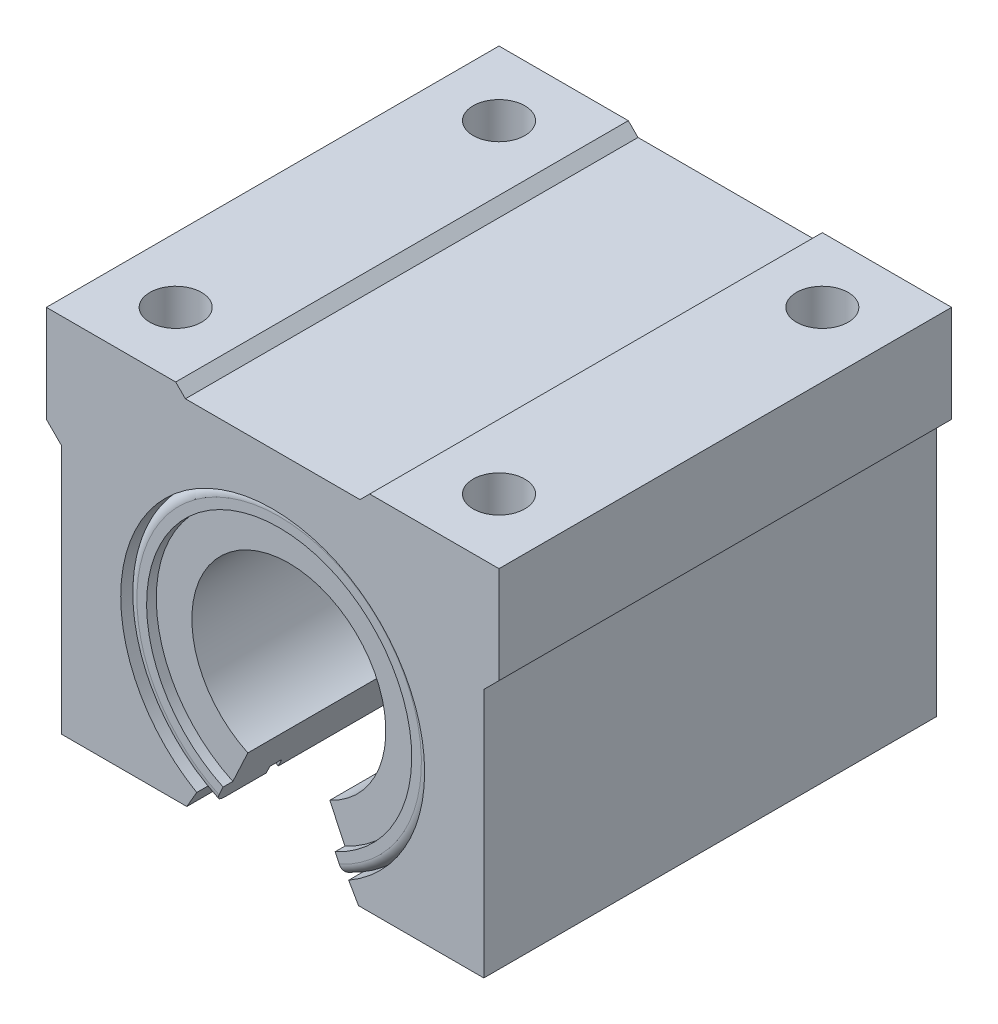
ISO-10303-21;
HEADER;
FILE_DESCRIPTION(('STEP AP214'),'2;1');
FILE_NAME('part.step','',(''),(''),'','','');
FILE_SCHEMA(('AUTOMOTIVE_DESIGN { 1 0 10303 214 1 1 1 1 }'));
ENDSEC;
DATA;
#1=APPLICATION_CONTEXT('core data for automotive mechanical design processes');
#2=APPLICATION_PROTOCOL_DEFINITION('international standard','automotive_design',2000,#1);
#3=PRODUCT_CONTEXT('',#1,'mechanical');
#4=PRODUCT('Part','Part','',(#3));
#5=PRODUCT_RELATED_PRODUCT_CATEGORY('part','',(#4));
#6=PRODUCT_DEFINITION_FORMATION('','',#4);
#7=PRODUCT_DEFINITION_CONTEXT('part definition',#1,'design');
#8=PRODUCT_DEFINITION('design','',#6,#7);
#9=PRODUCT_DEFINITION_SHAPE('','',#8);
#10=(LENGTH_UNIT() NAMED_UNIT(*) SI_UNIT(.MILLI.,.METRE.));
#11=(NAMED_UNIT(*) PLANE_ANGLE_UNIT() SI_UNIT($,.RADIAN.));
#12=(NAMED_UNIT(*) SI_UNIT($,.STERADIAN.) SOLID_ANGLE_UNIT());
#13=UNCERTAINTY_MEASURE_WITH_UNIT(LENGTH_MEASURE(1.E-05),#10,'distance_accuracy_value','');
#14=(GEOMETRIC_REPRESENTATION_CONTEXT(3) GLOBAL_UNCERTAINTY_ASSIGNED_CONTEXT((#13)) GLOBAL_UNIT_ASSIGNED_CONTEXT((#10,
#11,#12)) REPRESENTATION_CONTEXT('',''));
#15=CARTESIAN_POINT('',(0.,0.,0.));
#16=DIRECTION('',(0.,0.,1.));
#17=DIRECTION('',(1.,0.,0.));
#18=AXIS2_PLACEMENT_3D('',#15,#16,#17);
#19=CARTESIAN_POINT('',(0.,0.,34.));
#20=DIRECTION('',(0.,0.,-1.));
#21=DIRECTION('',(-1.,0.,0.));
#22=AXIS2_PLACEMENT_3D('',#19,#20,#21);
#23=CYLINDRICAL_SURFACE('',#22,15.);
#24=DIRECTION('',(0.,0.,-1.));
#25=VECTOR('',#24,1.);
#26=CARTESIAN_POINT('',(6.3392739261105,-13.5946168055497,34.));
#27=LINE('',#26,#25);
#28=CARTESIAN_POINT('',(6.3392739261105,-13.5946168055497,32.5));
#29=VERTEX_POINT('',#28);
#30=CARTESIAN_POINT('',(6.3392739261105,-13.5946168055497,-32.5));
#31=VERTEX_POINT('',#30);
#32=EDGE_CURVE('P0_E38',#29,#31,#27,.T.);
#33=ORIENTED_EDGE('',*,*,#32,.F.);
#34=CARTESIAN_POINT('',(0.,0.,32.5));
#35=DIRECTION('',(0.,0.,1.));
#36=DIRECTION('',(1.,0.,0.));
#37=AXIS2_PLACEMENT_3D('',#34,#35,#36);
#38=CIRCLE('',#37,15.);
#39=CARTESIAN_POINT('',(-6.3392739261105,-13.5946168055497,32.5));
#40=VERTEX_POINT('',#39);
#41=EDGE_CURVE('P0_E168',#29,#40,#38,.T.);
#42=ORIENTED_EDGE('',*,*,#41,.T.);
#43=DIRECTION('',(0.,0.,-1.));
#44=VECTOR('',#43,1.);
#45=CARTESIAN_POINT('',(-6.3392739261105,-13.5946168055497,34.));
#46=LINE('',#45,#44);
#47=CARTESIAN_POINT('',(-6.3392739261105,-13.5946168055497,-32.5));
#48=VERTEX_POINT('',#47);
#49=EDGE_CURVE('P0_E211',#48,#40,#46,.F.);
#50=ORIENTED_EDGE('',*,*,#49,.F.);
#51=CARTESIAN_POINT('',(0.,0.,-32.5));
#52=DIRECTION('',(0.,0.,-1.));
#53=DIRECTION('',(-1.,0.,0.));
#54=AXIS2_PLACEMENT_3D('',#51,#52,#53);
#55=CIRCLE('',#54,15.);
#56=EDGE_CURVE('P0_E166',#48,#31,#55,.T.);
#57=ORIENTED_EDGE('',*,*,#56,.T.);
#58=EDGE_LOOP('',(#33,#42,#50,#57));
#59=FACE_BOUND('',#58,.T.);
#60=ADVANCED_FACE('P0_F16',(#59),#23,.F.);
#61=CARTESIAN_POINT('',(0.,0.,-34.));
#62=DIRECTION('',(0.,0.,1.));
#63=DIRECTION('',(1.,0.,0.));
#64=AXIS2_PLACEMENT_3D('',#61,#62,#63);
#65=PLANE('',#64);
#66=CARTESIAN_POINT('',(0.,0.,-34.));
#67=DIRECTION('',(0.,0.,1.));
#68=DIRECTION('',(1.,0.,0.));
#69=AXIS2_PLACEMENT_3D('',#66,#67,#68);
#70=CIRCLE('',#69,22.);
#71=CARTESIAN_POINT('',(-9.29760175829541,-19.9387713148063,-34.));
#72=VERTEX_POINT('',#71);
#73=CARTESIAN_POINT('',(9.29760175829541,-19.9387713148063,-34.));
#74=VERTEX_POINT('',#73);
#75=EDGE_CURVE('P0_E202',#72,#74,#70,.F.);
#76=ORIENTED_EDGE('',*,*,#75,.T.);
#77=DIRECTION('',(-0.4226182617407,0.90630778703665,0.));
#78=VECTOR('',#77,1.);
#79=CARTESIAN_POINT('',(0.,0.,-34.));
#80=LINE('',#79,#78);
#81=CARTESIAN_POINT('',(8.66367436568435,-18.5793096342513,-34.));
#82=VERTEX_POINT('',#81);
#83=EDGE_CURVE('P0_E159',#74,#82,#80,.T.);
#84=ORIENTED_EDGE('',*,*,#83,.T.);
#85=CARTESIAN_POINT('',(0.,0.,-34.));
#86=DIRECTION('',(0.,0.,1.));
#87=DIRECTION('',(1.,0.,0.));
#88=AXIS2_PLACEMENT_3D('',#85,#86,#87);
#89=CIRCLE('',#88,20.5);
#90=CARTESIAN_POINT('',(-8.66367436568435,-18.5793096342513,-34.));
#91=VERTEX_POINT('',#90);
#92=EDGE_CURVE('P0_E228',#82,#91,#89,.T.);
#93=ORIENTED_EDGE('',*,*,#92,.T.);
#94=DIRECTION('',(-0.4226182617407,-0.90630778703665,0.));
#95=VECTOR('',#94,1.);
#96=CARTESIAN_POINT('',(0.,0.,-34.));
#97=LINE('',#96,#95);
#98=EDGE_CURVE('P0_E258',#91,#72,#97,.T.);
#99=ORIENTED_EDGE('',*,*,#98,.T.);
#100=EDGE_LOOP('',(#76,#84,#93,#99));
#101=FACE_BOUND('',#100,.T.);
#102=ADVANCED_FACE('P0_F257',(#101),#65,.F.);
#103=CARTESIAN_POINT('',(0.,0.,34.));
#104=DIRECTION('',(0.,0.,-1.));
#105=DIRECTION('',(-1.,0.,0.));
#106=AXIS2_PLACEMENT_3D('',#103,#104,#105);
#107=CYLINDRICAL_SURFACE('',#106,23.5);
#108=CARTESIAN_POINT('',(0.,0.,24.2));
#109=DIRECTION('',(0.,0.,1.));
#110=DIRECTION('',(1.,0.,0.));
#111=AXIS2_PLACEMENT_3D('',#108,#109,#110);
#112=CIRCLE('',#111,23.5);
#113=CARTESIAN_POINT('',(9.93152915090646,-21.2982329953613,24.2));
#114=VERTEX_POINT('',#113);
#115=CARTESIAN_POINT('',(-9.93152915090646,-21.2982329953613,24.2));
#116=VERTEX_POINT('',#115);
#117=EDGE_CURVE('P0_E187',#114,#116,#112,.T.);
#118=ORIENTED_EDGE('',*,*,#117,.F.);
#119=DIRECTION('',(0.,0.,1.));
#120=VECTOR('',#119,1.);
#121=CARTESIAN_POINT('',(9.93152915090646,-21.2982329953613,-34.));
#122=LINE('',#121,#120);
#123=CARTESIAN_POINT('',(9.93152915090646,-21.2982329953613,-24.2));
#124=VERTEX_POINT('',#123);
#125=EDGE_CURVE('P0_E268',#124,#114,#122,.T.);
#126=ORIENTED_EDGE('',*,*,#125,.F.);
#127=CARTESIAN_POINT('',(0.,0.,-24.2));
#128=DIRECTION('',(0.,0.,1.));
#129=DIRECTION('',(1.,0.,0.));
#130=AXIS2_PLACEMENT_3D('',#127,#128,#129);
#131=CIRCLE('',#130,23.5);
#132=CARTESIAN_POINT('',(-9.93152915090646,-21.2982329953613,-24.2));
#133=VERTEX_POINT('',#132);
#134=EDGE_CURVE('P0_E184',#124,#133,#131,.T.);
#135=ORIENTED_EDGE('',*,*,#134,.T.);
#136=DIRECTION('',(0.,0.,1.));
#137=VECTOR('',#136,1.);
#138=CARTESIAN_POINT('',(-9.93152915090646,-21.2982329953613,-34.));
#139=LINE('',#138,#137);
#140=EDGE_CURVE('P0_E273',#133,#116,#139,.T.);
#141=ORIENTED_EDGE('',*,*,#140,.T.);
#142=EDGE_LOOP('',(#118,#126,#135,#141));
#143=FACE_BOUND('',#142,.T.);
#144=ADVANCED_FACE('P0_F325',(#143),#107,.T.);
#145=CARTESIAN_POINT('',(0.,0.,-26.05));
#146=DIRECTION('',(0.,0.,1.));
#147=DIRECTION('',(1.,0.,0.));
#148=AXIS2_PLACEMENT_3D('',#145,#146,#147);
#149=CIRCLE('',#148,23.5);
#150=CARTESIAN_POINT('',(9.93152915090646,-21.2982329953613,-26.05));
#151=VERTEX_POINT('',#150);
#152=CARTESIAN_POINT('',(-9.93152915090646,-21.2982329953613,-26.05));
#153=VERTEX_POINT('',#152);
#154=EDGE_CURVE('P0_E181',#151,#153,#149,.T.);
#155=ORIENTED_EDGE('',*,*,#154,.F.);
#156=CARTESIAN_POINT('',(9.93152915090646,-21.2982329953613,-32.5));
#157=VERTEX_POINT('',#156);
#158=EDGE_CURVE('P0_E270',#157,#151,#122,.T.);
#159=ORIENTED_EDGE('',*,*,#158,.F.);
#160=CARTESIAN_POINT('',(0.,0.,-32.5));
#161=DIRECTION('',(0.,0.,1.));
#162=DIRECTION('',(1.,0.,0.));
#163=AXIS2_PLACEMENT_3D('',#160,#161,#162);
#164=CIRCLE('',#163,23.5);
#165=CARTESIAN_POINT('',(-9.93152915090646,-21.2982329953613,-32.5));
#166=VERTEX_POINT('',#165);
#167=EDGE_CURVE('P0_E199',#157,#166,#164,.T.);
#168=ORIENTED_EDGE('',*,*,#167,.T.);
#169=EDGE_CURVE('P0_E269',#166,#153,#139,.T.);
#170=ORIENTED_EDGE('',*,*,#169,.T.);
#171=EDGE_LOOP('',(#155,#159,#168,#170));
#172=FACE_BOUND('',#171,.T.);
#173=ADVANCED_FACE('P0_F333',(#172),#107,.T.);
#174=CARTESIAN_POINT('',(0.,0.,32.5));
#175=DIRECTION('',(0.,0.,1.));
#176=DIRECTION('',(1.,0.,0.));
#177=AXIS2_PLACEMENT_3D('',#174,#175,#176);
#178=CIRCLE('',#177,23.5);
#179=CARTESIAN_POINT('',(-9.93152915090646,-21.2982329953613,32.5));
#180=VERTEX_POINT('',#179);
#181=CARTESIAN_POINT('',(9.93152915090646,-21.2982329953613,32.5));
#182=VERTEX_POINT('',#181);
#183=EDGE_CURVE('P0_E206',#180,#182,#178,.F.);
#184=ORIENTED_EDGE('',*,*,#183,.T.);
#185=CARTESIAN_POINT('',(9.93152915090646,-21.2982329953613,26.05));
#186=VERTEX_POINT('',#185);
#187=EDGE_CURVE('P0_E266',#186,#182,#122,.T.);
#188=ORIENTED_EDGE('',*,*,#187,.F.);
#189=CARTESIAN_POINT('',(0.,0.,26.05));
#190=DIRECTION('',(0.,0.,1.));
#191=DIRECTION('',(1.,0.,0.));
#192=AXIS2_PLACEMENT_3D('',#189,#190,#191);
#193=CIRCLE('',#192,23.5);
#194=CARTESIAN_POINT('',(-9.93152915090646,-21.2982329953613,26.05));
#195=VERTEX_POINT('',#194);
#196=EDGE_CURVE('P0_E196',#186,#195,#193,.T.);
#197=ORIENTED_EDGE('',*,*,#196,.T.);
#198=EDGE_CURVE('P0_E262',#195,#180,#139,.T.);
#199=ORIENTED_EDGE('',*,*,#198,.T.);
#200=EDGE_LOOP('',(#184,#188,#197,#199));
#201=FACE_BOUND('',#200,.T.);
#202=ADVANCED_FACE('P0_F305',(#201),#107,.T.);
#203=CARTESIAN_POINT('',(0.,0.,34.));
#204=DIRECTION('',(0.,0.,1.));
#205=DIRECTION('',(1.,0.,0.));
#206=AXIS2_PLACEMENT_3D('',#203,#204,#205);
#207=PLANE('',#206);
#208=DIRECTION('',(-0.4226182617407,0.90630778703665,0.));
#209=VECTOR('',#208,1.);
#210=CARTESIAN_POINT('',(0.,0.,34.));
#211=LINE('',#210,#209);
#212=CARTESIAN_POINT('',(9.29760175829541,-19.9387713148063,34.));
#213=VERTEX_POINT('',#212);
#214=CARTESIAN_POINT('',(8.66367436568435,-18.5793096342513,34.));
#215=VERTEX_POINT('',#214);
#216=EDGE_CURVE('P0_E160',#213,#215,#211,.T.);
#217=ORIENTED_EDGE('',*,*,#216,.F.);
#218=CARTESIAN_POINT('',(0.,0.,34.));
#219=DIRECTION('',(0.,0.,1.));
#220=DIRECTION('',(1.,0.,0.));
#221=AXIS2_PLACEMENT_3D('',#218,#219,#220);
#222=CIRCLE('',#221,22.);
#223=CARTESIAN_POINT('',(-9.29760175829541,-19.9387713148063,34.));
#224=VERTEX_POINT('',#223);
#225=EDGE_CURVE('P0_E158',#213,#224,#222,.T.);
#226=ORIENTED_EDGE('',*,*,#225,.T.);
#227=DIRECTION('',(-0.4226182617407,-0.90630778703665,0.));
#228=VECTOR('',#227,1.);
#229=CARTESIAN_POINT('',(0.,0.,34.));
#230=LINE('',#229,#228);
#231=CARTESIAN_POINT('',(-8.66367436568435,-18.5793096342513,34.));
#232=VERTEX_POINT('',#231);
#233=EDGE_CURVE('P0_E141',#232,#224,#230,.T.);
#234=ORIENTED_EDGE('',*,*,#233,.F.);
#235=CARTESIAN_POINT('',(0.,0.,34.));
#236=DIRECTION('',(0.,0.,1.));
#237=DIRECTION('',(1.,0.,0.));
#238=AXIS2_PLACEMENT_3D('',#235,#236,#237);
#239=CIRCLE('',#238,20.5);
#240=EDGE_CURVE('P0_E156',#215,#232,#239,.T.);
#241=ORIENTED_EDGE('',*,*,#240,.F.);
#242=EDGE_LOOP('',(#217,#226,#234,#241));
#243=FACE_BOUND('',#242,.T.);
#244=ADVANCED_FACE('P0_F155',(#243),#207,.T.);
#245=CARTESIAN_POINT('',(-1.64099622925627E-13,-23.5,26.05));
#246=DIRECTION('',(0.,0.,-1.));
#247=DIRECTION('',(-1.,0.,0.));
#248=AXIS2_PLACEMENT_3D('',#245,#246,#247);
#249=PLANE('',#248);
#250=DIRECTION('',(0.4226182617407,-0.90630778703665,0.));
#251=VECTOR('',#250,1.);
#252=CARTESIAN_POINT('',(9.00102220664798,-19.3027544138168,26.05));
#253=LINE('',#252,#251);
#254=CARTESIAN_POINT('',(9.40325632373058,-20.1653482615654,26.05));
#255=VERTEX_POINT('',#254);
#256=EDGE_CURVE('P0_E253',#255,#186,#253,.T.);
#257=ORIENTED_EDGE('',*,*,#256,.F.);
#258=CARTESIAN_POINT('',(0.,0.,26.05));
#259=DIRECTION('',(0.,0.,1.));
#260=DIRECTION('',(1.,0.,0.));
#261=AXIS2_PLACEMENT_3D('',#258,#259,#260);
#262=CIRCLE('',#261,22.25);
#263=CARTESIAN_POINT('',(-9.40325632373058,-20.1653482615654,26.05));
#264=VERTEX_POINT('',#263);
#265=EDGE_CURVE('P0_E193',#255,#264,#262,.T.);
#266=ORIENTED_EDGE('',*,*,#265,.T.);
#267=DIRECTION('',(0.4226182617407,0.90630778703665,0.));
#268=VECTOR('',#267,1.);
#269=CARTESIAN_POINT('',(-9.00102220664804,-19.3027544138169,26.05));
#270=LINE('',#269,#268);
#271=EDGE_CURVE('P0_E229',#195,#264,#270,.T.);
#272=ORIENTED_EDGE('',*,*,#271,.F.);
#273=ORIENTED_EDGE('',*,*,#196,.F.);
#274=EDGE_LOOP('',(#257,#266,#272,#273));
#275=FACE_BOUND('',#274,.T.);
#276=ADVANCED_FACE('P0_F303',(#275),#249,.T.);
#277=CARTESIAN_POINT('',(0.,0.,0.));
#278=DIRECTION('',(0.,0.,1.));
#279=DIRECTION('',(1.,0.,0.));
#280=AXIS2_PLACEMENT_3D('',#277,#278,#279);
#281=CYLINDRICAL_SURFACE('',#280,22.25);
#282=DIRECTION('',(0.,0.,1.));
#283=VECTOR('',#282,1.);
#284=CARTESIAN_POINT('',(9.40325632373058,-20.1653482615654,0.));
#285=LINE('',#284,#283);
#286=CARTESIAN_POINT('',(9.40325632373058,-20.1653482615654,24.2));
#287=VERTEX_POINT('',#286);
#288=EDGE_CURVE('P0_E251',#287,#255,#285,.T.);
#289=ORIENTED_EDGE('',*,*,#288,.F.);
#290=CARTESIAN_POINT('',(0.,0.,24.2));
#291=DIRECTION('',(0.,0.,1.));
#292=DIRECTION('',(1.,0.,0.));
#293=AXIS2_PLACEMENT_3D('',#290,#291,#292);
#294=CIRCLE('',#293,22.25);
#295=CARTESIAN_POINT('',(-9.40325632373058,-20.1653482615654,24.2));
#296=VERTEX_POINT('',#295);
#297=EDGE_CURVE('P0_E190',#287,#296,#294,.T.);
#298=ORIENTED_EDGE('',*,*,#297,.T.);
#299=DIRECTION('',(0.,0.,1.));
#300=VECTOR('',#299,1.);
#301=CARTESIAN_POINT('',(-9.40325632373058,-20.1653482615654,0.));
#302=LINE('',#301,#300);
#303=EDGE_CURVE('P0_E233',#264,#296,#302,.F.);
#304=ORIENTED_EDGE('',*,*,#303,.F.);
#305=ORIENTED_EDGE('',*,*,#265,.F.);
#306=EDGE_LOOP('',(#289,#298,#304,#305));
#307=FACE_BOUND('',#306,.T.);
#308=ADVANCED_FACE('P0_F298',(#307),#281,.T.);
#309=CARTESIAN_POINT('',(-1.55370919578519E-13,-22.25,24.2));
#310=DIRECTION('',(0.,0.,1.));
#311=DIRECTION('',(1.,0.,0.));
#312=AXIS2_PLACEMENT_3D('',#309,#310,#311);
#313=PLANE('',#312);
#314=DIRECTION('',(-0.4226182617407,0.90630778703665,0.));
#315=VECTOR('',#314,1.);
#316=CARTESIAN_POINT('',(8.52224442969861,-18.2760121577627,24.2));
#317=LINE('',#316,#315);
#318=EDGE_CURVE('P0_E249',#114,#287,#317,.T.);
#319=ORIENTED_EDGE('',*,*,#318,.F.);
#320=ORIENTED_EDGE('',*,*,#117,.T.);
#321=DIRECTION('',(-0.4226182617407,-0.90630778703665,0.));
#322=VECTOR('',#321,1.);
#323=CARTESIAN_POINT('',(-8.52224442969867,-18.2760121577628,24.2));
#324=LINE('',#323,#322);
#325=EDGE_CURVE('P0_E285',#296,#116,#324,.T.);
#326=ORIENTED_EDGE('',*,*,#325,.F.);
#327=ORIENTED_EDGE('',*,*,#297,.F.);
#328=EDGE_LOOP('',(#319,#320,#326,#327));
#329=FACE_BOUND('',#328,.T.);
#330=ADVANCED_FACE('P0_F295',(#329),#313,.T.);
#331=CARTESIAN_POINT('',(-1.55370919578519E-13,-22.25,-24.2));
#332=DIRECTION('',(0.,0.,-1.));
#333=DIRECTION('',(-1.,0.,0.));
#334=AXIS2_PLACEMENT_3D('',#331,#332,#333);
#335=PLANE('',#334);
#336=DIRECTION('',(0.4226182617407,-0.90630778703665,0.));
#337=VECTOR('',#336,1.);
#338=CARTESIAN_POINT('',(8.52224442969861,-18.2760121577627,-24.2));
#339=LINE('',#338,#337);
#340=CARTESIAN_POINT('',(9.40325632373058,-20.1653482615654,-24.2));
#341=VERTEX_POINT('',#340);
#342=EDGE_CURVE('P0_E247',#341,#124,#339,.T.);
#343=ORIENTED_EDGE('',*,*,#342,.F.);
#344=CARTESIAN_POINT('',(0.,0.,-24.2));
#345=DIRECTION('',(0.,0.,1.));
#346=DIRECTION('',(1.,0.,0.));
#347=AXIS2_PLACEMENT_3D('',#344,#345,#346);
#348=CIRCLE('',#347,22.25);
#349=CARTESIAN_POINT('',(-9.40325632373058,-20.1653482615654,-24.2));
#350=VERTEX_POINT('',#349);
#351=EDGE_CURVE('P0_E175',#341,#350,#348,.T.);
#352=ORIENTED_EDGE('',*,*,#351,.T.);
#353=DIRECTION('',(0.4226182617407,0.90630778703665,0.));
#354=VECTOR('',#353,1.);
#355=CARTESIAN_POINT('',(-8.52224442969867,-18.2760121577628,-24.2));
#356=LINE('',#355,#354);
#357=EDGE_CURVE('P0_E283',#133,#350,#356,.T.);
#358=ORIENTED_EDGE('',*,*,#357,.F.);
#359=ORIENTED_EDGE('',*,*,#134,.F.);
#360=EDGE_LOOP('',(#343,#352,#358,#359));
#361=FACE_BOUND('',#360,.T.);
#362=ADVANCED_FACE('P0_F361',(#361),#335,.T.);
#363=CARTESIAN_POINT('',(-1.64099622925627E-13,-23.5,-26.05));
#364=DIRECTION('',(0.,0.,1.));
#365=DIRECTION('',(1.,0.,0.));
#366=AXIS2_PLACEMENT_3D('',#363,#364,#365);
#367=PLANE('',#366);
#368=DIRECTION('',(-0.4226182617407,0.90630778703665,0.));
#369=VECTOR('',#368,1.);
#370=CARTESIAN_POINT('',(9.00102220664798,-19.3027544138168,-26.05));
#371=LINE('',#370,#369);
#372=CARTESIAN_POINT('',(9.40325632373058,-20.1653482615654,-26.05));
#373=VERTEX_POINT('',#372);
#374=EDGE_CURVE('P0_E245',#151,#373,#371,.T.);
#375=ORIENTED_EDGE('',*,*,#374,.F.);
#376=ORIENTED_EDGE('',*,*,#154,.T.);
#377=DIRECTION('',(-0.4226182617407,-0.90630778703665,0.));
#378=VECTOR('',#377,1.);
#379=CARTESIAN_POINT('',(-9.00102220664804,-19.3027544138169,-26.05));
#380=LINE('',#379,#378);
#381=CARTESIAN_POINT('',(-9.40325632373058,-20.1653482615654,-26.05));
#382=VERTEX_POINT('',#381);
#383=EDGE_CURVE('P0_E281',#382,#153,#380,.T.);
#384=ORIENTED_EDGE('',*,*,#383,.F.);
#385=CARTESIAN_POINT('',(0.,0.,-26.05));
#386=DIRECTION('',(0.,0.,1.));
#387=DIRECTION('',(1.,0.,0.));
#388=AXIS2_PLACEMENT_3D('',#385,#386,#387);
#389=CIRCLE('',#388,22.25);
#390=EDGE_CURVE('P0_E178',#373,#382,#389,.T.);
#391=ORIENTED_EDGE('',*,*,#390,.F.);
#392=EDGE_LOOP('',(#375,#376,#384,#391));
#393=FACE_BOUND('',#392,.T.);
#394=ADVANCED_FACE('P0_F353',(#393),#367,.T.);
#395=CARTESIAN_POINT('',(0.,0.,0.));
#396=DIRECTION('',(0.,0.,1.));
#397=DIRECTION('',(1.,0.,0.));
#398=AXIS2_PLACEMENT_3D('',#395,#396,#397);
#399=CYLINDRICAL_SURFACE('',#398,22.25);
#400=DIRECTION('',(0.,0.,1.));
#401=VECTOR('',#400,1.);
#402=CARTESIAN_POINT('',(9.40325632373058,-20.1653482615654,0.));
#403=LINE('',#402,#401);
#404=EDGE_CURVE('P0_E243',#373,#341,#403,.T.);
#405=ORIENTED_EDGE('',*,*,#404,.F.);
#406=ORIENTED_EDGE('',*,*,#390,.T.);
#407=DIRECTION('',(0.,0.,1.));
#408=VECTOR('',#407,1.);
#409=CARTESIAN_POINT('',(-9.40325632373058,-20.1653482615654,0.));
#410=LINE('',#409,#408);
#411=EDGE_CURVE('P0_E279',#350,#382,#410,.F.);
#412=ORIENTED_EDGE('',*,*,#411,.F.);
#413=ORIENTED_EDGE('',*,*,#351,.F.);
#414=EDGE_LOOP('',(#405,#406,#412,#413));
#415=FACE_BOUND('',#414,.T.);
#416=ADVANCED_FACE('P0_F318',(#415),#399,.T.);
#417=CARTESIAN_POINT('',(0.,0.,-32.5));
#418=DIRECTION('',(0.,0.,1.));
#419=DIRECTION('',(1.,0.,0.));
#420=AXIS2_PLACEMENT_3D('',#417,#418,#419);
#421=TOROIDAL_SURFACE('',#420,22.,1.5);
#422=CARTESIAN_POINT('',(9.29760175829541,-19.9387713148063,-32.5));
#423=DIRECTION('',(0.90630778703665,0.4226182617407,0.));
#424=DIRECTION('',(-0.4226182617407,0.90630778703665,0.));
#425=AXIS2_PLACEMENT_3D('',#422,#423,#424);
#426=CIRCLE('',#425,1.5);
#427=EDGE_CURVE('P0_E241',#74,#157,#426,.F.);
#428=ORIENTED_EDGE('',*,*,#427,.F.);
#429=ORIENTED_EDGE('',*,*,#75,.F.);
#430=CARTESIAN_POINT('',(-9.29760175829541,-19.9387713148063,-32.5));
#431=DIRECTION('',(-0.90630778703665,0.4226182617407,0.));
#432=DIRECTION('',(-0.4226182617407,-0.90630778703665,0.));
#433=AXIS2_PLACEMENT_3D('',#430,#431,#432);
#434=CIRCLE('',#433,1.5);
#435=EDGE_CURVE('P0_E277',#166,#72,#434,.F.);
#436=ORIENTED_EDGE('',*,*,#435,.F.);
#437=ORIENTED_EDGE('',*,*,#167,.F.);
#438=EDGE_LOOP('',(#428,#429,#436,#437));
#439=FACE_BOUND('',#438,.T.);
#440=ADVANCED_FACE('P0_F310',(#439),#421,.T.);
#441=CARTESIAN_POINT('',(0.,0.,32.5));
#442=DIRECTION('',(0.,0.,1.));
#443=DIRECTION('',(1.,0.,0.));
#444=AXIS2_PLACEMENT_3D('',#441,#442,#443);
#445=TOROIDAL_SURFACE('',#444,22.,1.5);
#446=CARTESIAN_POINT('',(9.29760175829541,-19.9387713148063,32.5));
#447=DIRECTION('',(0.90630778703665,0.4226182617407,0.));
#448=DIRECTION('',(-0.4226182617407,0.90630778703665,0.));
#449=AXIS2_PLACEMENT_3D('',#446,#447,#448);
#450=CIRCLE('',#449,1.5);
#451=EDGE_CURVE('P0_E239',#182,#213,#450,.F.);
#452=ORIENTED_EDGE('',*,*,#451,.F.);
#453=ORIENTED_EDGE('',*,*,#183,.F.);
#454=CARTESIAN_POINT('',(-9.29760175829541,-19.9387713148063,32.5));
#455=DIRECTION('',(-0.90630778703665,0.4226182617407,0.));
#456=DIRECTION('',(-0.4226182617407,-0.90630778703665,0.));
#457=AXIS2_PLACEMENT_3D('',#454,#455,#456);
#458=CIRCLE('',#457,1.5);
#459=EDGE_CURVE('P0_E149',#224,#180,#458,.F.);
#460=ORIENTED_EDGE('',*,*,#459,.F.);
#461=ORIENTED_EDGE('',*,*,#225,.F.);
#462=EDGE_LOOP('',(#452,#453,#460,#461));
#463=FACE_BOUND('',#462,.T.);
#464=ADVANCED_FACE('P0_F18',(#463),#445,.T.);
#465=CARTESIAN_POINT('',(0.,0.,32.5));
#466=DIRECTION('',(0.,0.,1.));
#467=DIRECTION('',(1.,0.,0.));
#468=AXIS2_PLACEMENT_3D('',#465,#466,#467);
#469=CYLINDRICAL_SURFACE('',#468,20.5);
#470=CARTESIAN_POINT('',(0.,0.,32.5));
#471=DIRECTION('',(0.,0.,1.));
#472=DIRECTION('',(1.,0.,0.));
#473=AXIS2_PLACEMENT_3D('',#470,#471,#472);
#474=CIRCLE('',#473,20.5);
#475=CARTESIAN_POINT('',(8.66367436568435,-18.5793096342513,32.5));
#476=VERTEX_POINT('',#475);
#477=CARTESIAN_POINT('',(-8.66367436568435,-18.5793096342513,32.5));
#478=VERTEX_POINT('',#477);
#479=EDGE_CURVE('P0_E165',#476,#478,#474,.T.);
#480=ORIENTED_EDGE('',*,*,#479,.F.);
#481=DIRECTION('',(0.,0.,1.));
#482=VECTOR('',#481,1.);
#483=CARTESIAN_POINT('',(8.66367436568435,-18.5793096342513,32.5));
#484=LINE('',#483,#482);
#485=EDGE_CURVE('P0_E164',#476,#215,#484,.T.);
#486=ORIENTED_EDGE('',*,*,#485,.T.);
#487=ORIENTED_EDGE('',*,*,#240,.T.);
#488=DIRECTION('',(0.,0.,1.));
#489=VECTOR('',#488,1.);
#490=CARTESIAN_POINT('',(-8.66367436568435,-18.5793096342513,32.5));
#491=LINE('',#490,#489);
#492=EDGE_CURVE('P0_E138',#232,#478,#491,.F.);
#493=ORIENTED_EDGE('',*,*,#492,.T.);
#494=EDGE_LOOP('',(#480,#486,#487,#493));
#495=FACE_BOUND('',#494,.T.);
#496=ADVANCED_FACE('P0_F163',(#495),#469,.F.);
#497=CARTESIAN_POINT('',(0.,0.,32.5));
#498=DIRECTION('',(0.,0.,1.));
#499=DIRECTION('',(1.,0.,0.));
#500=AXIS2_PLACEMENT_3D('',#497,#498,#499);
#501=PLANE('',#500);
#502=DIRECTION('',(-0.4226182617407,0.90630778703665,0.));
#503=VECTOR('',#502,1.);
#504=CARTESIAN_POINT('',(0.,0.,32.5));
#505=LINE('',#504,#503);
#506=EDGE_CURVE('P0_E231',#476,#29,#505,.T.);
#507=ORIENTED_EDGE('',*,*,#506,.F.);
#508=ORIENTED_EDGE('',*,*,#479,.T.);
#509=DIRECTION('',(-0.4226182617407,-0.90630778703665,0.));
#510=VECTOR('',#509,1.);
#511=CARTESIAN_POINT('',(0.,0.,32.5));
#512=LINE('',#511,#510);
#513=EDGE_CURVE('P0_E144',#40,#478,#512,.T.);
#514=ORIENTED_EDGE('',*,*,#513,.F.);
#515=ORIENTED_EDGE('',*,*,#41,.F.);
#516=EDGE_LOOP('',(#507,#508,#514,#515));
#517=FACE_BOUND('',#516,.T.);
#518=ADVANCED_FACE('P0_F316',(#517),#501,.T.);
#519=CARTESIAN_POINT('',(0.,0.,-32.5));
#520=DIRECTION('',(0.,0.,-1.));
#521=DIRECTION('',(-1.,0.,0.));
#522=AXIS2_PLACEMENT_3D('',#519,#520,#521);
#523=CYLINDRICAL_SURFACE('',#522,20.5);
#524=DIRECTION('',(0.,0.,-1.));
#525=VECTOR('',#524,1.);
#526=CARTESIAN_POINT('',(8.66367436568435,-18.5793096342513,-32.5));
#527=LINE('',#526,#525);
#528=CARTESIAN_POINT('',(8.66367436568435,-18.5793096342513,-32.5));
#529=VERTEX_POINT('',#528);
#530=EDGE_CURVE('P0_E222',#529,#82,#527,.T.);
#531=ORIENTED_EDGE('',*,*,#530,.F.);
#532=CARTESIAN_POINT('',(0.,0.,-32.5));
#533=DIRECTION('',(0.,0.,1.));
#534=DIRECTION('',(1.,0.,0.));
#535=AXIS2_PLACEMENT_3D('',#532,#533,#534);
#536=CIRCLE('',#535,20.5);
#537=CARTESIAN_POINT('',(-8.66367436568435,-18.5793096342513,-32.5));
#538=VERTEX_POINT('',#537);
#539=EDGE_CURVE('P0_E171',#529,#538,#536,.T.);
#540=ORIENTED_EDGE('',*,*,#539,.T.);
#541=DIRECTION('',(0.,0.,-1.));
#542=VECTOR('',#541,1.);
#543=CARTESIAN_POINT('',(-8.66367436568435,-18.5793096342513,-32.5));
#544=LINE('',#543,#542);
#545=EDGE_CURVE('P0_E31',#91,#538,#544,.F.);
#546=ORIENTED_EDGE('',*,*,#545,.F.);
#547=ORIENTED_EDGE('',*,*,#92,.F.);
#548=EDGE_LOOP('',(#531,#540,#546,#547));
#549=FACE_BOUND('',#548,.T.);
#550=ADVANCED_FACE('P0_F226',(#549),#523,.F.);
#551=CARTESIAN_POINT('',(0.,0.,-32.5));
#552=DIRECTION('',(0.,0.,-1.));
#553=DIRECTION('',(1.,0.,0.));
#554=AXIS2_PLACEMENT_3D('',#551,#552,#553);
#555=PLANE('',#554);
#556=DIRECTION('',(0.4226182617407,-0.90630778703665,0.));
#557=VECTOR('',#556,1.);
#558=CARTESIAN_POINT('',(0.,0.,-32.5));
#559=LINE('',#558,#557);
#560=EDGE_CURVE('P0_E11',#31,#529,#559,.T.);
#561=ORIENTED_EDGE('',*,*,#560,.F.);
#562=ORIENTED_EDGE('',*,*,#56,.F.);
#563=DIRECTION('',(0.4226182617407,0.90630778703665,0.));
#564=VECTOR('',#563,1.);
#565=CARTESIAN_POINT('',(0.,0.,-32.5));
#566=LINE('',#565,#564);
#567=EDGE_CURVE('P0_E24',#538,#48,#566,.T.);
#568=ORIENTED_EDGE('',*,*,#567,.F.);
#569=ORIENTED_EDGE('',*,*,#539,.F.);
#570=EDGE_LOOP('',(#561,#562,#568,#569));
#571=FACE_BOUND('',#570,.T.);
#572=ADVANCED_FACE('P0_F219',(#571),#555,.T.);
#573=CARTESIAN_POINT('',(0.,0.,-34.));
#574=DIRECTION('',(-0.90630778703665,0.4226182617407,0.));
#575=DIRECTION('',(-0.4226182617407,-0.90630778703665,0.));
#576=AXIS2_PLACEMENT_3D('',#573,#574,#575);
#577=PLANE('',#576);
#578=ORIENTED_EDGE('',*,*,#271,.T.);
#579=ORIENTED_EDGE('',*,*,#303,.T.);
#580=ORIENTED_EDGE('',*,*,#325,.T.);
#581=ORIENTED_EDGE('',*,*,#140,.F.);
#582=ORIENTED_EDGE('',*,*,#357,.T.);
#583=ORIENTED_EDGE('',*,*,#411,.T.);
#584=ORIENTED_EDGE('',*,*,#383,.T.);
#585=ORIENTED_EDGE('',*,*,#169,.F.);
#586=ORIENTED_EDGE('',*,*,#435,.T.);
#587=ORIENTED_EDGE('',*,*,#98,.F.);
#588=ORIENTED_EDGE('',*,*,#545,.T.);
#589=ORIENTED_EDGE('',*,*,#567,.T.);
#590=ORIENTED_EDGE('',*,*,#49,.T.);
#591=ORIENTED_EDGE('',*,*,#513,.T.);
#592=ORIENTED_EDGE('',*,*,#492,.F.);
#593=ORIENTED_EDGE('',*,*,#233,.T.);
#594=ORIENTED_EDGE('',*,*,#459,.T.);
#595=ORIENTED_EDGE('',*,*,#198,.F.);
#596=EDGE_LOOP('',(#578,#579,#580,#581,#582,#583,#584,#585,#586,#587,#588,#589,#590,#591,#592,
#593,#594,#595));
#597=FACE_BOUND('',#596,.T.);
#598=ADVANCED_FACE('P0_F140',(#597),#577,.F.);
#599=CARTESIAN_POINT('',(0.,0.,-34.));
#600=DIRECTION('',(0.90630778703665,0.4226182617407,0.));
#601=DIRECTION('',(-0.4226182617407,0.90630778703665,0.));
#602=AXIS2_PLACEMENT_3D('',#599,#600,#601);
#603=PLANE('',#602);
#604=ORIENTED_EDGE('',*,*,#256,.T.);
#605=ORIENTED_EDGE('',*,*,#187,.T.);
#606=ORIENTED_EDGE('',*,*,#451,.T.);
#607=ORIENTED_EDGE('',*,*,#216,.T.);
#608=ORIENTED_EDGE('',*,*,#485,.F.);
#609=ORIENTED_EDGE('',*,*,#506,.T.);
#610=ORIENTED_EDGE('',*,*,#32,.T.);
#611=ORIENTED_EDGE('',*,*,#560,.T.);
#612=ORIENTED_EDGE('',*,*,#530,.T.);
#613=ORIENTED_EDGE('',*,*,#83,.F.);
#614=ORIENTED_EDGE('',*,*,#427,.T.);
#615=ORIENTED_EDGE('',*,*,#158,.T.);
#616=ORIENTED_EDGE('',*,*,#374,.T.);
#617=ORIENTED_EDGE('',*,*,#404,.T.);
#618=ORIENTED_EDGE('',*,*,#342,.T.);
#619=ORIENTED_EDGE('',*,*,#125,.T.);
#620=ORIENTED_EDGE('',*,*,#318,.T.);
#621=ORIENTED_EDGE('',*,*,#288,.T.);
#622=EDGE_LOOP('',(#604,#605,#606,#607,#608,#609,#610,#611,#612,#613,#614,#615,#616,#617,#618,
#619,#620,#621));
#623=FACE_BOUND('',#622,.T.);
#624=ADVANCED_FACE('P0_F221',(#623),#603,.F.);
#625=CLOSED_SHELL('',(#60,#102,#144,#173,#202,#244,#276,#308,#330,#362,#394,#416,#440,#464,#496,
#518,#550,#572,#598,#624));
#626=MANIFOLD_SOLID_BREP('P0_B1',#625);
#627=CARTESIAN_POINT('',(35.,33.,-35.));
#628=DIRECTION('',(0.,1.,0.));
#629=DIRECTION('',(-1.,0.,0.));
#630=AXIS2_PLACEMENT_3D('',#627,#628,#629);
#631=PLANE('',#630);
#632=CARTESIAN_POINT('',(-25.,33.,-25.));
#633=DIRECTION('',(0.,1.,0.));
#634=DIRECTION('',(-1.,0.,0.));
#635=AXIS2_PLACEMENT_3D('',#632,#633,#634);
#636=CIRCLE('',#635,4.);
#637=CARTESIAN_POINT('',(-29.,33.,-25.));
#638=VERTEX_POINT('',#637);
#639=EDGE_CURVE('P1_E329',#638,#638,#636,.T.);
#640=ORIENTED_EDGE('',*,*,#639,.F.);
#641=EDGE_LOOP('',(#640));
#642=FACE_BOUND('',#641,.T.);
#643=DIRECTION('',(0.,0.,1.));
#644=VECTOR('',#643,1.);
#645=CARTESIAN_POINT('',(-15.,33.,-35.));
#646=LINE('',#645,#644);
#647=CARTESIAN_POINT('',(-15.,33.,-35.));
#648=VERTEX_POINT('',#647);
#649=CARTESIAN_POINT('',(-15.,33.,35.));
#650=VERTEX_POINT('',#649);
#651=EDGE_CURVE('P1_E261',#648,#650,#646,.T.);
#652=ORIENTED_EDGE('',*,*,#651,.F.);
#653=DIRECTION('',(-1.,0.,0.));
#654=VECTOR('',#653,1.);
#655=CARTESIAN_POINT('',(35.,33.,-35.));
#656=LINE('',#655,#654);
#657=CARTESIAN_POINT('',(-35.,33.,-35.));
#658=VERTEX_POINT('',#657);
#659=EDGE_CURVE('P1_E276',#648,#658,#656,.T.);
#660=ORIENTED_EDGE('',*,*,#659,.T.);
#661=DIRECTION('',(0.,0.,1.));
#662=VECTOR('',#661,1.);
#663=CARTESIAN_POINT('',(-35.,33.,-35.));
#664=LINE('',#663,#662);
#665=CARTESIAN_POINT('',(-35.,33.,35.));
#666=VERTEX_POINT('',#665);
#667=EDGE_CURVE('P1_E190',#658,#666,#664,.T.);
#668=ORIENTED_EDGE('',*,*,#667,.T.);
#669=DIRECTION('',(-1.,0.,0.));
#670=VECTOR('',#669,1.);
#671=CARTESIAN_POINT('',(35.,33.,35.));
#672=LINE('',#671,#670);
#673=EDGE_CURVE('P1_E169',#650,#666,#672,.T.);
#674=ORIENTED_EDGE('',*,*,#673,.F.);
#675=EDGE_LOOP('',(#652,#660,#668,#674));
#676=FACE_BOUND('',#675,.T.);
#677=CARTESIAN_POINT('',(-25.,33.,25.));
#678=DIRECTION('',(0.,1.,0.));
#679=DIRECTION('',(-1.,0.,0.));
#680=AXIS2_PLACEMENT_3D('',#677,#678,#679);
#681=CIRCLE('',#680,4.);
#682=CARTESIAN_POINT('',(-29.,33.,25.));
#683=VERTEX_POINT('',#682);
#684=EDGE_CURVE('P1_E292',#683,#683,#681,.T.);
#685=ORIENTED_EDGE('',*,*,#684,.F.);
#686=EDGE_LOOP('',(#685));
#687=FACE_BOUND('',#686,.T.);
#688=ADVANCED_FACE('P1_F15',(#642,#676,#687),#631,.T.);
#689=CARTESIAN_POINT('',(0.,0.,-35.));
#690=DIRECTION('',(0.,0.,1.));
#691=DIRECTION('',(1.,0.,0.));
#692=AXIS2_PLACEMENT_3D('',#689,#690,#691);
#693=CYLINDRICAL_SURFACE('',#692,23.5);
#694=CARTESIAN_POINT('',(0.,0.,35.));
#695=DIRECTION('',(0.,0.,-1.));
#696=DIRECTION('',(1.,0.,0.));
#697=AXIS2_PLACEMENT_3D('',#694,#695,#696);
#698=CIRCLE('',#697,23.5);
#699=CARTESIAN_POINT('',(-11.75,-20.3515969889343,35.));
#700=VERTEX_POINT('',#699);
#701=CARTESIAN_POINT('',(11.75,-20.3515969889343,35.));
#702=VERTEX_POINT('',#701);
#703=EDGE_CURVE('P1_E150',#700,#702,#698,.T.);
#704=ORIENTED_EDGE('',*,*,#703,.F.);
#705=DIRECTION('',(0.,0.,1.));
#706=VECTOR('',#705,1.);
#707=CARTESIAN_POINT('',(-11.75,-20.3515969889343,-35.));
#708=LINE('',#707,#706);
#709=CARTESIAN_POINT('',(-11.75,-20.3515969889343,-35.));
#710=VERTEX_POINT('',#709);
#711=EDGE_CURVE('P1_E10',#710,#700,#708,.T.);
#712=ORIENTED_EDGE('',*,*,#711,.F.);
#713=CARTESIAN_POINT('',(0.,0.,-35.));
#714=DIRECTION('',(0.,0.,-1.));
#715=DIRECTION('',(1.,0.,0.));
#716=AXIS2_PLACEMENT_3D('',#713,#714,#715);
#717=CIRCLE('',#716,23.5);
#718=CARTESIAN_POINT('',(11.75,-20.3515969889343,-35.));
#719=VERTEX_POINT('',#718);
#720=EDGE_CURVE('P1_E184',#710,#719,#717,.T.);
#721=ORIENTED_EDGE('',*,*,#720,.T.);
#722=DIRECTION('',(0.,0.,1.));
#723=VECTOR('',#722,1.);
#724=CARTESIAN_POINT('',(11.75,-20.3515969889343,-35.));
#725=LINE('',#724,#723);
#726=EDGE_CURVE('P1_E19',#719,#702,#725,.T.);
#727=ORIENTED_EDGE('',*,*,#726,.T.);
#728=EDGE_LOOP('',(#704,#712,#721,#727));
#729=FACE_BOUND('',#728,.T.);
#730=ADVANCED_FACE('P1_F17',(#729),#693,.F.);
#731=CARTESIAN_POINT('',(-11.75,-20.3515969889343,-35.));
#732=DIRECTION('',(0.866025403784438,-0.500000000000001,0.));
#733=DIRECTION('',(0.500000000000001,0.866025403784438,0.));
#734=AXIS2_PLACEMENT_3D('',#731,#732,#733);
#735=PLANE('',#734);
#736=DIRECTION('',(0.500000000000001,0.866025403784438,0.));
#737=VECTOR('',#736,1.);
#738=CARTESIAN_POINT('',(-11.75,-20.3515969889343,35.));
#739=LINE('',#738,#737);
#740=CARTESIAN_POINT('',(-13.2790561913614,-23.,35.));
#741=VERTEX_POINT('',#740);
#742=EDGE_CURVE('P1_E182',#741,#700,#739,.T.);
#743=ORIENTED_EDGE('',*,*,#742,.F.);
#744=DIRECTION('',(0.,0.,1.));
#745=VECTOR('',#744,1.);
#746=CARTESIAN_POINT('',(-13.2790561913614,-23.,-35.));
#747=LINE('',#746,#745);
#748=CARTESIAN_POINT('',(-13.2790561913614,-23.,-35.));
#749=VERTEX_POINT('',#748);
#750=EDGE_CURVE('P1_E24',#749,#741,#747,.T.);
#751=ORIENTED_EDGE('',*,*,#750,.F.);
#752=DIRECTION('',(0.500000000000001,0.866025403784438,0.));
#753=VECTOR('',#752,1.);
#754=CARTESIAN_POINT('',(-11.75,-20.3515969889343,-35.));
#755=LINE('',#754,#753);
#756=EDGE_CURVE('P1_E140',#749,#710,#755,.T.);
#757=ORIENTED_EDGE('',*,*,#756,.T.);
#758=ORIENTED_EDGE('',*,*,#711,.T.);
#759=EDGE_LOOP('',(#743,#751,#757,#758));
#760=FACE_BOUND('',#759,.T.);
#761=ADVANCED_FACE('P1_F205',(#760),#735,.T.);
#762=CARTESIAN_POINT('',(-32.65,-23.,-35.));
#763=DIRECTION('',(0.,-1.,0.));
#764=DIRECTION('',(1.,0.,0.));
#765=AXIS2_PLACEMENT_3D('',#762,#763,#764);
#766=PLANE('',#765);
#767=DIRECTION('',(1.,0.,0.));
#768=VECTOR('',#767,1.);
#769=CARTESIAN_POINT('',(-32.65,-23.,35.));
#770=LINE('',#769,#768);
#771=CARTESIAN_POINT('',(-32.65,-23.,35.));
#772=VERTEX_POINT('',#771);
#773=EDGE_CURVE('P1_E126',#772,#741,#770,.T.);
#774=ORIENTED_EDGE('',*,*,#773,.F.);
#775=DIRECTION('',(0.,0.,1.));
#776=VECTOR('',#775,1.);
#777=CARTESIAN_POINT('',(-32.65,-23.,-35.));
#778=LINE('',#777,#776);
#779=CARTESIAN_POINT('',(-32.65,-23.,-35.));
#780=VERTEX_POINT('',#779);
#781=EDGE_CURVE('P1_E120',#780,#772,#778,.T.);
#782=ORIENTED_EDGE('',*,*,#781,.F.);
#783=DIRECTION('',(1.,0.,0.));
#784=VECTOR('',#783,1.);
#785=CARTESIAN_POINT('',(-32.65,-23.,-35.));
#786=LINE('',#785,#784);
#787=EDGE_CURVE('P1_E123',#780,#749,#786,.T.);
#788=ORIENTED_EDGE('',*,*,#787,.T.);
#789=ORIENTED_EDGE('',*,*,#750,.T.);
#790=EDGE_LOOP('',(#774,#782,#788,#789));
#791=FACE_BOUND('',#790,.T.);
#792=ADVANCED_FACE('P1_F122',(#791),#766,.T.);
#793=CARTESIAN_POINT('',(-32.65,15.65,-35.));
#794=DIRECTION('',(-1.,0.,0.));
#795=DIRECTION('',(0.,-1.,0.));
#796=AXIS2_PLACEMENT_3D('',#793,#794,#795);
#797=PLANE('',#796);
#798=DIRECTION('',(0.,-1.,0.));
#799=VECTOR('',#798,1.);
#800=CARTESIAN_POINT('',(-32.65,15.65,35.));
#801=LINE('',#800,#799);
#802=CARTESIAN_POINT('',(-32.65,15.65,35.));
#803=VERTEX_POINT('',#802);
#804=EDGE_CURVE('P1_E179',#803,#772,#801,.T.);
#805=ORIENTED_EDGE('',*,*,#804,.F.);
#806=DIRECTION('',(0.,0.,1.));
#807=VECTOR('',#806,1.);
#808=CARTESIAN_POINT('',(-32.65,15.65,-35.));
#809=LINE('',#808,#807);
#810=CARTESIAN_POINT('',(-32.65,15.65,-35.));
#811=VERTEX_POINT('',#810);
#812=EDGE_CURVE('P1_E131',#811,#803,#809,.T.);
#813=ORIENTED_EDGE('',*,*,#812,.F.);
#814=DIRECTION('',(0.,-1.,0.));
#815=VECTOR('',#814,1.);
#816=CARTESIAN_POINT('',(-32.65,15.65,-35.));
#817=LINE('',#816,#815);
#818=EDGE_CURVE('P1_E138',#811,#780,#817,.T.);
#819=ORIENTED_EDGE('',*,*,#818,.T.);
#820=ORIENTED_EDGE('',*,*,#781,.T.);
#821=EDGE_LOOP('',(#805,#813,#819,#820));
#822=FACE_BOUND('',#821,.T.);
#823=ADVANCED_FACE('P1_F142',(#822),#797,.T.);
#824=CARTESIAN_POINT('',(-35.,18.,-35.));
#825=DIRECTION('',(-0.707106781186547,-0.707106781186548,0.));
#826=DIRECTION('',(0.707106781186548,-0.707106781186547,0.));
#827=AXIS2_PLACEMENT_3D('',#824,#825,#826);
#828=PLANE('',#827);
#829=DIRECTION('',(0.707106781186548,-0.707106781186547,0.));
#830=VECTOR('',#829,1.);
#831=CARTESIAN_POINT('',(-35.,18.,35.));
#832=LINE('',#831,#830);
#833=CARTESIAN_POINT('',(-35.,18.,35.));
#834=VERTEX_POINT('',#833);
#835=EDGE_CURVE('P1_E176',#834,#803,#832,.T.);
#836=ORIENTED_EDGE('',*,*,#835,.F.);
#837=DIRECTION('',(0.,0.,1.));
#838=VECTOR('',#837,1.);
#839=CARTESIAN_POINT('',(-35.,18.,-35.));
#840=LINE('',#839,#838);
#841=CARTESIAN_POINT('',(-35.,18.,-35.));
#842=VERTEX_POINT('',#841);
#843=EDGE_CURVE('P1_E188',#842,#834,#840,.T.);
#844=ORIENTED_EDGE('',*,*,#843,.F.);
#845=DIRECTION('',(0.707106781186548,-0.707106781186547,0.));
#846=VECTOR('',#845,1.);
#847=CARTESIAN_POINT('',(-35.,18.,-35.));
#848=LINE('',#847,#846);
#849=EDGE_CURVE('P1_E143',#842,#811,#848,.T.);
#850=ORIENTED_EDGE('',*,*,#849,.T.);
#851=ORIENTED_EDGE('',*,*,#812,.T.);
#852=EDGE_LOOP('',(#836,#844,#850,#851));
#853=FACE_BOUND('',#852,.T.);
#854=ADVANCED_FACE('P1_F235',(#853),#828,.T.);
#855=CARTESIAN_POINT('',(-35.,33.,-35.));
#856=DIRECTION('',(-1.,0.,0.));
#857=DIRECTION('',(0.,0.,1.));
#858=AXIS2_PLACEMENT_3D('',#855,#856,#857);
#859=PLANE('',#858);
#860=DIRECTION('',(0.,-1.,0.));
#861=VECTOR('',#860,1.);
#862=CARTESIAN_POINT('',(-35.,33.,35.));
#863=LINE('',#862,#861);
#864=EDGE_CURVE('P1_E173',#666,#834,#863,.T.);
#865=ORIENTED_EDGE('',*,*,#864,.F.);
#866=ORIENTED_EDGE('',*,*,#667,.F.);
#867=DIRECTION('',(0.,-1.,0.));
#868=VECTOR('',#867,1.);
#869=CARTESIAN_POINT('',(-35.,33.,-35.));
#870=LINE('',#869,#868);
#871=EDGE_CURVE('P1_E145',#658,#842,#870,.T.);
#872=ORIENTED_EDGE('',*,*,#871,.T.);
#873=ORIENTED_EDGE('',*,*,#843,.T.);
#874=EDGE_LOOP('',(#865,#866,#872,#873));
#875=FACE_BOUND('',#874,.T.);
#876=ADVANCED_FACE('P1_F227',(#875),#859,.T.);
#877=CARTESIAN_POINT('',(25.,33.,25.));
#878=DIRECTION('',(0.,1.,0.));
#879=DIRECTION('',(-1.,0.,0.));
#880=AXIS2_PLACEMENT_3D('',#877,#878,#879);
#881=CIRCLE('',#880,4.);
#882=CARTESIAN_POINT('',(21.,33.,25.));
#883=VERTEX_POINT('',#882);
#884=EDGE_CURVE('P1_E240',#883,#883,#881,.T.);
#885=ORIENTED_EDGE('',*,*,#884,.F.);
#886=EDGE_LOOP('',(#885));
#887=FACE_BOUND('',#886,.T.);
#888=CARTESIAN_POINT('',(25.,33.,-25.));
#889=DIRECTION('',(0.,1.,0.));
#890=DIRECTION('',(-1.,0.,0.));
#891=AXIS2_PLACEMENT_3D('',#888,#889,#890);
#892=CIRCLE('',#891,4.);
#893=CARTESIAN_POINT('',(21.,33.,-25.));
#894=VERTEX_POINT('',#893);
#895=EDGE_CURVE('P1_E244',#894,#894,#892,.T.);
#896=ORIENTED_EDGE('',*,*,#895,.F.);
#897=EDGE_LOOP('',(#896));
#898=FACE_BOUND('',#897,.T.);
#899=DIRECTION('',(0.,0.,1.));
#900=VECTOR('',#899,1.);
#901=CARTESIAN_POINT('',(15.,33.,-35.));
#902=LINE('',#901,#900);
#903=CARTESIAN_POINT('',(15.,33.,-35.));
#904=VERTEX_POINT('',#903);
#905=CARTESIAN_POINT('',(15.,33.,35.));
#906=VERTEX_POINT('',#905);
#907=EDGE_CURVE('P1_E250',#904,#906,#902,.T.);
#908=ORIENTED_EDGE('',*,*,#907,.T.);
#909=CARTESIAN_POINT('',(35.,33.,35.));
#910=VERTEX_POINT('',#909);
#911=EDGE_CURVE('P1_E170',#910,#906,#672,.T.);
#912=ORIENTED_EDGE('',*,*,#911,.F.);
#913=DIRECTION('',(0.,0.,1.));
#914=VECTOR('',#913,1.);
#915=CARTESIAN_POINT('',(35.,33.,-35.));
#916=LINE('',#915,#914);
#917=CARTESIAN_POINT('',(35.,33.,-35.));
#918=VERTEX_POINT('',#917);
#919=EDGE_CURVE('P1_E193',#918,#910,#916,.T.);
#920=ORIENTED_EDGE('',*,*,#919,.F.);
#921=EDGE_CURVE('P1_E253',#918,#904,#656,.T.);
#922=ORIENTED_EDGE('',*,*,#921,.T.);
#923=EDGE_LOOP('',(#908,#912,#920,#922));
#924=FACE_BOUND('',#923,.T.);
#925=ADVANCED_FACE('P1_F218',(#887,#898,#924),#631,.T.);
#926=CARTESIAN_POINT('',(35.,33.,-35.));
#927=DIRECTION('',(1.,0.,0.));
#928=DIRECTION('',(0.,0.,-1.));
#929=AXIS2_PLACEMENT_3D('',#926,#927,#928);
#930=PLANE('',#929);
#931=DIRECTION('',(0.,1.,0.));
#932=VECTOR('',#931,1.);
#933=CARTESIAN_POINT('',(35.,33.,35.));
#934=LINE('',#933,#932);
#935=CARTESIAN_POINT('',(35.,18.,35.));
#936=VERTEX_POINT('',#935);
#937=EDGE_CURVE('P1_E166',#936,#910,#934,.T.);
#938=ORIENTED_EDGE('',*,*,#937,.F.);
#939=DIRECTION('',(0.,0.,1.));
#940=VECTOR('',#939,1.);
#941=CARTESIAN_POINT('',(35.,18.,-35.));
#942=LINE('',#941,#940);
#943=CARTESIAN_POINT('',(35.,18.,-35.));
#944=VERTEX_POINT('',#943);
#945=EDGE_CURVE('P1_E195',#944,#936,#942,.T.);
#946=ORIENTED_EDGE('',*,*,#945,.F.);
#947=DIRECTION('',(0.,1.,0.));
#948=VECTOR('',#947,1.);
#949=CARTESIAN_POINT('',(35.,33.,-35.));
#950=LINE('',#949,#948);
#951=EDGE_CURVE('P1_E271',#944,#918,#950,.T.);
#952=ORIENTED_EDGE('',*,*,#951,.T.);
#953=ORIENTED_EDGE('',*,*,#919,.T.);
#954=EDGE_LOOP('',(#938,#946,#952,#953));
#955=FACE_BOUND('',#954,.T.);
#956=ADVANCED_FACE('P1_F226',(#955),#930,.T.);
#957=CARTESIAN_POINT('',(35.,18.,-35.));
#958=DIRECTION('',(0.707106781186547,-0.707106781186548,0.));
#959=DIRECTION('',(0.707106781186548,0.707106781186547,0.));
#960=AXIS2_PLACEMENT_3D('',#957,#958,#959);
#961=PLANE('',#960);
#962=DIRECTION('',(0.707106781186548,0.707106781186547,0.));
#963=VECTOR('',#962,1.);
#964=CARTESIAN_POINT('',(35.,18.,35.));
#965=LINE('',#964,#963);
#966=CARTESIAN_POINT('',(32.65,15.65,35.));
#967=VERTEX_POINT('',#966);
#968=EDGE_CURVE('P1_E163',#967,#936,#965,.T.);
#969=ORIENTED_EDGE('',*,*,#968,.F.);
#970=DIRECTION('',(0.,0.,1.));
#971=VECTOR('',#970,1.);
#972=CARTESIAN_POINT('',(32.65,15.65,-35.));
#973=LINE('',#972,#971);
#974=CARTESIAN_POINT('',(32.65,15.65,-35.));
#975=VERTEX_POINT('',#974);
#976=EDGE_CURVE('P1_E197',#975,#967,#973,.T.);
#977=ORIENTED_EDGE('',*,*,#976,.F.);
#978=DIRECTION('',(0.707106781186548,0.707106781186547,0.));
#979=VECTOR('',#978,1.);
#980=CARTESIAN_POINT('',(35.,18.,-35.));
#981=LINE('',#980,#979);
#982=EDGE_CURVE('P1_E281',#975,#944,#981,.T.);
#983=ORIENTED_EDGE('',*,*,#982,.T.);
#984=ORIENTED_EDGE('',*,*,#945,.T.);
#985=EDGE_LOOP('',(#969,#977,#983,#984));
#986=FACE_BOUND('',#985,.T.);
#987=ADVANCED_FACE('P1_F233',(#986),#961,.T.);
#988=CARTESIAN_POINT('',(32.65,15.65,-35.));
#989=DIRECTION('',(1.,0.,0.));
#990=DIRECTION('',(0.,0.,-1.));
#991=AXIS2_PLACEMENT_3D('',#988,#989,#990);
#992=PLANE('',#991);
#993=DIRECTION('',(0.,1.,0.));
#994=VECTOR('',#993,1.);
#995=CARTESIAN_POINT('',(32.65,15.65,35.));
#996=LINE('',#995,#994);
#997=CARTESIAN_POINT('',(32.65,-23.,35.));
#998=VERTEX_POINT('',#997);
#999=EDGE_CURVE('P1_E160',#998,#967,#996,.T.);
#1000=ORIENTED_EDGE('',*,*,#999,.F.);
#1001=DIRECTION('',(0.,0.,1.));
#1002=VECTOR('',#1001,1.);
#1003=CARTESIAN_POINT('',(32.65,-23.,-35.));
#1004=LINE('',#1003,#1002);
#1005=CARTESIAN_POINT('',(32.65,-23.,-35.));
#1006=VERTEX_POINT('',#1005);
#1007=EDGE_CURVE('P1_E199',#1006,#998,#1004,.T.);
#1008=ORIENTED_EDGE('',*,*,#1007,.F.);
#1009=DIRECTION('',(0.,1.,0.));
#1010=VECTOR('',#1009,1.);
#1011=CARTESIAN_POINT('',(32.65,15.65,-35.));
#1012=LINE('',#1011,#1010);
#1013=EDGE_CURVE('P1_E283',#1006,#975,#1012,.T.);
#1014=ORIENTED_EDGE('',*,*,#1013,.T.);
#1015=ORIENTED_EDGE('',*,*,#976,.T.);
#1016=EDGE_LOOP('',(#1000,#1008,#1014,#1015));
#1017=FACE_BOUND('',#1016,.T.);
#1018=ADVANCED_FACE('P1_F575',(#1017),#992,.T.);
#1019=CARTESIAN_POINT('',(32.65,-23.,-35.));
#1020=DIRECTION('',(0.,-1.,0.));
#1021=DIRECTION('',(0.,0.,-1.));
#1022=AXIS2_PLACEMENT_3D('',#1019,#1020,#1021);
#1023=PLANE('',#1022);
#1024=DIRECTION('',(1.,0.,0.));
#1025=VECTOR('',#1024,1.);
#1026=CARTESIAN_POINT('',(32.65,-23.,35.));
#1027=LINE('',#1026,#1025);
#1028=CARTESIAN_POINT('',(13.2790561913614,-23.,35.));
#1029=VERTEX_POINT('',#1028);
#1030=EDGE_CURVE('P1_E157',#1029,#998,#1027,.T.);
#1031=ORIENTED_EDGE('',*,*,#1030,.F.);
#1032=DIRECTION('',(0.,0.,1.));
#1033=VECTOR('',#1032,1.);
#1034=CARTESIAN_POINT('',(13.2790561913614,-23.,-35.));
#1035=LINE('',#1034,#1033);
#1036=CARTESIAN_POINT('',(13.2790561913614,-23.,-35.));
#1037=VERTEX_POINT('',#1036);
#1038=EDGE_CURVE('P1_E200',#1037,#1029,#1035,.T.);
#1039=ORIENTED_EDGE('',*,*,#1038,.F.);
#1040=DIRECTION('',(1.,0.,0.));
#1041=VECTOR('',#1040,1.);
#1042=CARTESIAN_POINT('',(32.65,-23.,-35.));
#1043=LINE('',#1042,#1041);
#1044=EDGE_CURVE('P1_E286',#1037,#1006,#1043,.T.);
#1045=ORIENTED_EDGE('',*,*,#1044,.T.);
#1046=ORIENTED_EDGE('',*,*,#1007,.T.);
#1047=EDGE_LOOP('',(#1031,#1039,#1045,#1046));
#1048=FACE_BOUND('',#1047,.T.);
#1049=ADVANCED_FACE('P1_F568',(#1048),#1023,.T.);
#1050=CARTESIAN_POINT('',(11.75,-20.3515969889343,-35.));
#1051=DIRECTION('',(-0.866025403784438,-0.500000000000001,0.));
#1052=DIRECTION('',(0.500000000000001,-0.866025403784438,0.));
#1053=AXIS2_PLACEMENT_3D('',#1050,#1051,#1052);
#1054=PLANE('',#1053);
#1055=DIRECTION('',(0.500000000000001,-0.866025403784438,0.));
#1056=VECTOR('',#1055,1.);
#1057=CARTESIAN_POINT('',(11.75,-20.3515969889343,35.));
#1058=LINE('',#1057,#1056);
#1059=EDGE_CURVE('P1_E153',#702,#1029,#1058,.T.);
#1060=ORIENTED_EDGE('',*,*,#1059,.F.);
#1061=ORIENTED_EDGE('',*,*,#726,.F.);
#1062=DIRECTION('',(0.500000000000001,-0.866025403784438,0.));
#1063=VECTOR('',#1062,1.);
#1064=CARTESIAN_POINT('',(11.75,-20.3515969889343,-35.));
#1065=LINE('',#1064,#1063);
#1066=EDGE_CURVE('P1_E289',#719,#1037,#1065,.T.);
#1067=ORIENTED_EDGE('',*,*,#1066,.T.);
#1068=ORIENTED_EDGE('',*,*,#1038,.T.);
#1069=EDGE_LOOP('',(#1060,#1061,#1067,#1068));
#1070=FACE_BOUND('',#1069,.T.);
#1071=ADVANCED_FACE('P1_F202',(#1070),#1054,.T.);
#1072=CARTESIAN_POINT('',(0.,0.,-35.));
#1073=DIRECTION('',(0.,0.,1.));
#1074=DIRECTION('',(1.,0.,0.));
#1075=AXIS2_PLACEMENT_3D('',#1072,#1073,#1074);
#1076=PLANE('',#1075);
#1077=ORIENTED_EDGE('',*,*,#659,.F.);
#1078=DIRECTION('',(0.707106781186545,-0.70710678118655,0.));
#1079=VECTOR('',#1078,1.);
#1080=CARTESIAN_POINT('',(-13.5,31.5,-35.));
#1081=LINE('',#1080,#1079);
#1082=CARTESIAN_POINT('',(-13.5,31.5,-35.));
#1083=VERTEX_POINT('',#1082);
#1084=EDGE_CURVE('P1_E309',#648,#1083,#1081,.T.);
#1085=ORIENTED_EDGE('',*,*,#1084,.T.);
#1086=DIRECTION('',(1.,0.,0.));
#1087=VECTOR('',#1086,1.);
#1088=CARTESIAN_POINT('',(13.5,31.5,-35.));
#1089=LINE('',#1088,#1087);
#1090=CARTESIAN_POINT('',(13.5,31.5,-35.));
#1091=VERTEX_POINT('',#1090);
#1092=EDGE_CURVE('P1_E316',#1083,#1091,#1089,.T.);
#1093=ORIENTED_EDGE('',*,*,#1092,.T.);
#1094=DIRECTION('',(0.707106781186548,0.707106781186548,0.));
#1095=VECTOR('',#1094,1.);
#1096=CARTESIAN_POINT('',(15.,33.,-35.));
#1097=LINE('',#1096,#1095);
#1098=EDGE_CURVE('P1_E275',#1091,#904,#1097,.T.);
#1099=ORIENTED_EDGE('',*,*,#1098,.T.);
#1100=ORIENTED_EDGE('',*,*,#921,.F.);
#1101=ORIENTED_EDGE('',*,*,#951,.F.);
#1102=ORIENTED_EDGE('',*,*,#982,.F.);
#1103=ORIENTED_EDGE('',*,*,#1013,.F.);
#1104=ORIENTED_EDGE('',*,*,#1044,.F.);
#1105=ORIENTED_EDGE('',*,*,#1066,.F.);
#1106=ORIENTED_EDGE('',*,*,#720,.F.);
#1107=ORIENTED_EDGE('',*,*,#756,.F.);
#1108=ORIENTED_EDGE('',*,*,#787,.F.);
#1109=ORIENTED_EDGE('',*,*,#818,.F.);
#1110=ORIENTED_EDGE('',*,*,#849,.F.);
#1111=ORIENTED_EDGE('',*,*,#871,.F.);
#1112=EDGE_LOOP('',(#1077,#1085,#1093,#1099,#1100,#1101,#1102,#1103,#1104,#1105,#1106,#1107,
#1108,#1109,#1110,#1111));
#1113=FACE_BOUND('',#1112,.T.);
#1114=ADVANCED_FACE('P1_F136',(#1113),#1076,.F.);
#1115=CARTESIAN_POINT('',(0.,0.,35.));
#1116=DIRECTION('',(0.,0.,1.));
#1117=DIRECTION('',(1.,0.,0.));
#1118=AXIS2_PLACEMENT_3D('',#1115,#1116,#1117);
#1119=PLANE('',#1118);
#1120=DIRECTION('',(0.707106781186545,-0.70710678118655,0.));
#1121=VECTOR('',#1120,1.);
#1122=CARTESIAN_POINT('',(-13.5,31.5,35.));
#1123=LINE('',#1122,#1121);
#1124=CARTESIAN_POINT('',(-13.5,31.5,35.));
#1125=VERTEX_POINT('',#1124);
#1126=EDGE_CURVE('P1_E32',#650,#1125,#1123,.T.);
#1127=ORIENTED_EDGE('',*,*,#1126,.F.);
#1128=ORIENTED_EDGE('',*,*,#673,.T.);
#1129=ORIENTED_EDGE('',*,*,#864,.T.);
#1130=ORIENTED_EDGE('',*,*,#835,.T.);
#1131=ORIENTED_EDGE('',*,*,#804,.T.);
#1132=ORIENTED_EDGE('',*,*,#773,.T.);
#1133=ORIENTED_EDGE('',*,*,#742,.T.);
#1134=ORIENTED_EDGE('',*,*,#703,.T.);
#1135=ORIENTED_EDGE('',*,*,#1059,.T.);
#1136=ORIENTED_EDGE('',*,*,#1030,.T.);
#1137=ORIENTED_EDGE('',*,*,#999,.T.);
#1138=ORIENTED_EDGE('',*,*,#968,.T.);
#1139=ORIENTED_EDGE('',*,*,#937,.T.);
#1140=ORIENTED_EDGE('',*,*,#911,.T.);
#1141=DIRECTION('',(0.707106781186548,0.707106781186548,0.));
#1142=VECTOR('',#1141,1.);
#1143=CARTESIAN_POINT('',(15.,33.,35.));
#1144=LINE('',#1143,#1142);
#1145=CARTESIAN_POINT('',(13.5,31.5,35.));
#1146=VERTEX_POINT('',#1145);
#1147=EDGE_CURVE('P1_E266',#1146,#906,#1144,.T.);
#1148=ORIENTED_EDGE('',*,*,#1147,.F.);
#1149=DIRECTION('',(1.,0.,0.));
#1150=VECTOR('',#1149,1.);
#1151=CARTESIAN_POINT('',(13.5,31.5,35.));
#1152=LINE('',#1151,#1150);
#1153=EDGE_CURVE('P1_E310',#1125,#1146,#1152,.T.);
#1154=ORIENTED_EDGE('',*,*,#1153,.F.);
#1155=EDGE_LOOP('',(#1127,#1128,#1129,#1130,#1131,#1132,#1133,#1134,#1135,#1136,#1137,#1138,
#1139,#1140,#1148,#1154));
#1156=FACE_BOUND('',#1155,.T.);
#1157=ADVANCED_FACE('P1_F204',(#1156),#1119,.T.);
#1158=CARTESIAN_POINT('',(-25.,15.,25.));
#1159=DIRECTION('',(0.,1.,0.));
#1160=DIRECTION('',(-1.,0.,0.));
#1161=AXIS2_PLACEMENT_3D('',#1158,#1159,#1160);
#1162=CYLINDRICAL_SURFACE('',#1161,4.);
#1163=CARTESIAN_POINT('',(-25.,15.,25.));
#1164=DIRECTION('',(0.,1.,0.));
#1165=DIRECTION('',(-1.,0.,0.));
#1166=AXIS2_PLACEMENT_3D('',#1163,#1164,#1165);
#1167=CIRCLE('',#1166,4.);
#1168=CARTESIAN_POINT('',(-29.,15.,25.));
#1169=VERTEX_POINT('',#1168);
#1170=EDGE_CURVE('P1_E154',#1169,#1169,#1167,.T.);
#1171=ORIENTED_EDGE('',*,*,#1170,.F.);
#1172=EDGE_LOOP('',(#1171));
#1173=FACE_BOUND('',#1172,.T.);
#1174=ORIENTED_EDGE('',*,*,#684,.T.);
#1175=EDGE_LOOP('',(#1174));
#1176=FACE_BOUND('',#1175,.T.);
#1177=ADVANCED_FACE('P1_F424',(#1173,#1176),#1162,.F.);
#1178=CARTESIAN_POINT('',(-25.,15.,25.));
#1179=DIRECTION('',(0.,1.,0.));
#1180=DIRECTION('',(-1.,0.,0.));
#1181=AXIS2_PLACEMENT_3D('',#1178,#1179,#1180);
#1182=PLANE('',#1181);
#1183=CARTESIAN_POINT('',(-25.,15.,25.));
#1184=DIRECTION('',(0.,1.,0.));
#1185=DIRECTION('',(-1.,0.,0.));
#1186=AXIS2_PLACEMENT_3D('',#1183,#1184,#1185);
#1187=CIRCLE('',#1186,3.4);
#1188=CARTESIAN_POINT('',(-28.4,15.,25.));
#1189=VERTEX_POINT('',#1188);
#1190=EDGE_CURVE('P1_E295',#1189,#1189,#1187,.T.);
#1191=ORIENTED_EDGE('',*,*,#1190,.F.);
#1192=EDGE_LOOP('',(#1191));
#1193=FACE_BOUND('',#1192,.T.);
#1194=ORIENTED_EDGE('',*,*,#1170,.T.);
#1195=EDGE_LOOP('',(#1194));
#1196=FACE_BOUND('',#1195,.T.);
#1197=ADVANCED_FACE('P1_F420',(#1193,#1196),#1182,.T.);
#1198=CARTESIAN_POINT('',(-25.,11.,25.));
#1199=DIRECTION('',(0.,1.,0.));
#1200=DIRECTION('',(-1.,0.,0.));
#1201=AXIS2_PLACEMENT_3D('',#1198,#1199,#1200);
#1202=CYLINDRICAL_SURFACE('',#1201,3.4);
#1203=ORIENTED_EDGE('',*,*,#1190,.T.);
#1204=EDGE_LOOP('',(#1203));
#1205=FACE_BOUND('',#1204,.T.);
#1206=CARTESIAN_POINT('',(-25.,11.,25.));
#1207=DIRECTION('',(0.,1.,0.));
#1208=DIRECTION('',(-1.,0.,0.));
#1209=AXIS2_PLACEMENT_3D('',#1206,#1207,#1208);
#1210=CIRCLE('',#1209,3.4);
#1211=CARTESIAN_POINT('',(-28.4,11.,25.));
#1212=VERTEX_POINT('',#1211);
#1213=EDGE_CURVE('P1_E300',#1212,#1212,#1210,.T.);
#1214=ORIENTED_EDGE('',*,*,#1213,.F.);
#1215=EDGE_LOOP('',(#1214));
#1216=FACE_BOUND('',#1215,.T.);
#1217=ADVANCED_FACE('P1_F416',(#1205,#1216),#1202,.F.);
#1218=CARTESIAN_POINT('',(-25.,11.,25.));
#1219=DIRECTION('',(0.,1.,0.));
#1220=DIRECTION('',(-1.,0.,0.));
#1221=AXIS2_PLACEMENT_3D('',#1218,#1219,#1220);
#1222=CONICAL_SURFACE('',#1221,3.4,1.0471975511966);
#1223=CARTESIAN_POINT('',(-25.,9.03700908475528,25.));
#1224=VERTEX_POINT('',#1223);
#1225=VERTEX_LOOP('',#1224);
#1226=FACE_BOUND('',#1225,.T.);
#1227=ORIENTED_EDGE('',*,*,#1213,.T.);
#1228=EDGE_LOOP('',(#1227));
#1229=FACE_BOUND('',#1228,.T.);
#1230=ADVANCED_FACE('P1_F413',(#1226,#1229),#1222,.F.);
#1231=CARTESIAN_POINT('',(-13.5,31.5,-35.));
#1232=DIRECTION('',(-0.70710678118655,-0.707106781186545,0.));
#1233=DIRECTION('',(0.707106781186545,-0.70710678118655,0.));
#1234=AXIS2_PLACEMENT_3D('',#1231,#1232,#1233);
#1235=PLANE('',#1234);
#1236=ORIENTED_EDGE('',*,*,#1126,.T.);
#1237=DIRECTION('',(0.,0.,1.));
#1238=VECTOR('',#1237,1.);
#1239=CARTESIAN_POINT('',(-13.5,31.5,-35.));
#1240=LINE('',#1239,#1238);
#1241=EDGE_CURVE('P1_E303',#1083,#1125,#1240,.T.);
#1242=ORIENTED_EDGE('',*,*,#1241,.F.);
#1243=ORIENTED_EDGE('',*,*,#1084,.F.);
#1244=ORIENTED_EDGE('',*,*,#651,.T.);
#1245=EDGE_LOOP('',(#1236,#1242,#1243,#1244));
#1246=FACE_BOUND('',#1245,.T.);
#1247=ADVANCED_FACE('P1_F407',(#1246),#1235,.F.);
#1248=CARTESIAN_POINT('',(15.,33.,-35.));
#1249=DIRECTION('',(0.707106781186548,-0.707106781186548,0.));
#1250=DIRECTION('',(0.707106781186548,0.707106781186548,0.));
#1251=AXIS2_PLACEMENT_3D('',#1248,#1249,#1250);
#1252=PLANE('',#1251);
#1253=ORIENTED_EDGE('',*,*,#1147,.T.);
#1254=ORIENTED_EDGE('',*,*,#907,.F.);
#1255=ORIENTED_EDGE('',*,*,#1098,.F.);
#1256=DIRECTION('',(0.,0.,1.));
#1257=VECTOR('',#1256,1.);
#1258=CARTESIAN_POINT('',(13.5,31.5,-35.));
#1259=LINE('',#1258,#1257);
#1260=EDGE_CURVE('P1_E262',#1091,#1146,#1259,.T.);
#1261=ORIENTED_EDGE('',*,*,#1260,.T.);
#1262=EDGE_LOOP('',(#1253,#1254,#1255,#1261));
#1263=FACE_BOUND('',#1262,.T.);
#1264=ADVANCED_FACE('P1_F404',(#1263),#1252,.F.);
#1265=CARTESIAN_POINT('',(13.5,31.5,-35.));
#1266=DIRECTION('',(0.,-1.,0.));
#1267=DIRECTION('',(1.,0.,0.));
#1268=AXIS2_PLACEMENT_3D('',#1265,#1266,#1267);
#1269=PLANE('',#1268);
#1270=ORIENTED_EDGE('',*,*,#1153,.T.);
#1271=ORIENTED_EDGE('',*,*,#1260,.F.);
#1272=ORIENTED_EDGE('',*,*,#1092,.F.);
#1273=ORIENTED_EDGE('',*,*,#1241,.T.);
#1274=EDGE_LOOP('',(#1270,#1271,#1272,#1273));
#1275=FACE_BOUND('',#1274,.T.);
#1276=ADVANCED_FACE('P1_F402',(#1275),#1269,.F.);
#1277=CARTESIAN_POINT('',(25.,15.,-25.));
#1278=DIRECTION('',(0.,1.,0.));
#1279=DIRECTION('',(-1.,0.,0.));
#1280=AXIS2_PLACEMENT_3D('',#1277,#1278,#1279);
#1281=CYLINDRICAL_SURFACE('',#1280,4.);
#1282=CARTESIAN_POINT('',(25.,15.,-25.));
#1283=DIRECTION('',(0.,1.,0.));
#1284=DIRECTION('',(-1.,0.,0.));
#1285=AXIS2_PLACEMENT_3D('',#1282,#1283,#1284);
#1286=CIRCLE('',#1285,4.);
#1287=CARTESIAN_POINT('',(21.,15.,-25.));
#1288=VERTEX_POINT('',#1287);
#1289=EDGE_CURVE('P1_E321',#1288,#1288,#1286,.T.);
#1290=ORIENTED_EDGE('',*,*,#1289,.F.);
#1291=EDGE_LOOP('',(#1290));
#1292=FACE_BOUND('',#1291,.T.);
#1293=ORIENTED_EDGE('',*,*,#895,.T.);
#1294=EDGE_LOOP('',(#1293));
#1295=FACE_BOUND('',#1294,.T.);
#1296=ADVANCED_FACE('P1_F398',(#1292,#1295),#1281,.F.);
#1297=CARTESIAN_POINT('',(25.,15.,-25.));
#1298=DIRECTION('',(0.,1.,0.));
#1299=DIRECTION('',(-1.,0.,0.));
#1300=AXIS2_PLACEMENT_3D('',#1297,#1298,#1299);
#1301=PLANE('',#1300);
#1302=CARTESIAN_POINT('',(25.,15.,-25.));
#1303=DIRECTION('',(0.,1.,0.));
#1304=DIRECTION('',(-1.,0.,0.));
#1305=AXIS2_PLACEMENT_3D('',#1302,#1303,#1304);
#1306=CIRCLE('',#1305,3.4);
#1307=CARTESIAN_POINT('',(21.6,15.,-25.));
#1308=VERTEX_POINT('',#1307);
#1309=EDGE_CURVE('P1_E322',#1308,#1308,#1306,.T.);
#1310=ORIENTED_EDGE('',*,*,#1309,.F.);
#1311=EDGE_LOOP('',(#1310));
#1312=FACE_BOUND('',#1311,.T.);
#1313=ORIENTED_EDGE('',*,*,#1289,.T.);
#1314=EDGE_LOOP('',(#1313));
#1315=FACE_BOUND('',#1314,.T.);
#1316=ADVANCED_FACE('P1_F394',(#1312,#1315),#1301,.T.);
#1317=CARTESIAN_POINT('',(25.,15.,25.));
#1318=DIRECTION('',(0.,1.,0.));
#1319=DIRECTION('',(-1.,0.,0.));
#1320=AXIS2_PLACEMENT_3D('',#1317,#1318,#1319);
#1321=CYLINDRICAL_SURFACE('',#1320,4.);
#1322=CARTESIAN_POINT('',(25.,15.,25.));
#1323=DIRECTION('',(0.,1.,0.));
#1324=DIRECTION('',(-1.,0.,0.));
#1325=AXIS2_PLACEMENT_3D('',#1322,#1323,#1324);
#1326=CIRCLE('',#1325,4.);
#1327=CARTESIAN_POINT('',(21.,15.,25.));
#1328=VERTEX_POINT('',#1327);
#1329=EDGE_CURVE('P1_E326',#1328,#1328,#1326,.T.);
#1330=ORIENTED_EDGE('',*,*,#1329,.F.);
#1331=EDGE_LOOP('',(#1330));
#1332=FACE_BOUND('',#1331,.T.);
#1333=ORIENTED_EDGE('',*,*,#884,.T.);
#1334=EDGE_LOOP('',(#1333));
#1335=FACE_BOUND('',#1334,.T.);
#1336=ADVANCED_FACE('P1_F390',(#1332,#1335),#1321,.F.);
#1337=CARTESIAN_POINT('',(25.,15.,25.));
#1338=DIRECTION('',(0.,1.,0.));
#1339=DIRECTION('',(-1.,0.,0.));
#1340=AXIS2_PLACEMENT_3D('',#1337,#1338,#1339);
#1341=PLANE('',#1340);
#1342=CARTESIAN_POINT('',(25.,15.,25.));
#1343=DIRECTION('',(0.,1.,0.));
#1344=DIRECTION('',(-1.,0.,0.));
#1345=AXIS2_PLACEMENT_3D('',#1342,#1343,#1344);
#1346=CIRCLE('',#1345,3.4);
#1347=CARTESIAN_POINT('',(21.6,15.,25.));
#1348=VERTEX_POINT('',#1347);
#1349=EDGE_CURVE('P1_E336',#1348,#1348,#1346,.T.);
#1350=ORIENTED_EDGE('',*,*,#1349,.F.);
#1351=EDGE_LOOP('',(#1350));
#1352=FACE_BOUND('',#1351,.T.);
#1353=ORIENTED_EDGE('',*,*,#1329,.T.);
#1354=EDGE_LOOP('',(#1353));
#1355=FACE_BOUND('',#1354,.T.);
#1356=ADVANCED_FACE('P1_F386',(#1352,#1355),#1341,.T.);
#1357=CARTESIAN_POINT('',(-25.,15.,-25.));
#1358=DIRECTION('',(0.,1.,0.));
#1359=DIRECTION('',(-1.,0.,0.));
#1360=AXIS2_PLACEMENT_3D('',#1357,#1358,#1359);
#1361=CYLINDRICAL_SURFACE('',#1360,4.);
#1362=CARTESIAN_POINT('',(-25.,15.,-25.));
#1363=DIRECTION('',(0.,1.,0.));
#1364=DIRECTION('',(-1.,0.,0.));
#1365=AXIS2_PLACEMENT_3D('',#1362,#1363,#1364);
#1366=CIRCLE('',#1365,4.);
#1367=CARTESIAN_POINT('',(-29.,15.,-25.));
#1368=VERTEX_POINT('',#1367);
#1369=EDGE_CURVE('P1_E314',#1368,#1368,#1366,.T.);
#1370=ORIENTED_EDGE('',*,*,#1369,.F.);
#1371=EDGE_LOOP('',(#1370));
#1372=FACE_BOUND('',#1371,.T.);
#1373=ORIENTED_EDGE('',*,*,#639,.T.);
#1374=EDGE_LOOP('',(#1373));
#1375=FACE_BOUND('',#1374,.T.);
#1376=ADVANCED_FACE('P1_F365',(#1372,#1375),#1361,.F.);
#1377=CARTESIAN_POINT('',(-25.,15.,-25.));
#1378=DIRECTION('',(0.,1.,0.));
#1379=DIRECTION('',(-1.,0.,0.));
#1380=AXIS2_PLACEMENT_3D('',#1377,#1378,#1379);
#1381=PLANE('',#1380);
#1382=CARTESIAN_POINT('',(-25.,15.,-25.));
#1383=DIRECTION('',(0.,1.,0.));
#1384=DIRECTION('',(-1.,0.,0.));
#1385=AXIS2_PLACEMENT_3D('',#1382,#1383,#1384);
#1386=CIRCLE('',#1385,3.4);
#1387=CARTESIAN_POINT('',(-28.4,15.,-25.));
#1388=VERTEX_POINT('',#1387);
#1389=EDGE_CURVE('P1_E339',#1388,#1388,#1386,.T.);
#1390=ORIENTED_EDGE('',*,*,#1389,.F.);
#1391=EDGE_LOOP('',(#1390));
#1392=FACE_BOUND('',#1391,.T.);
#1393=ORIENTED_EDGE('',*,*,#1369,.T.);
#1394=EDGE_LOOP('',(#1393));
#1395=FACE_BOUND('',#1394,.T.);
#1396=ADVANCED_FACE('P1_F356',(#1392,#1395),#1381,.T.);
#1397=CARTESIAN_POINT('',(-25.,11.,-25.));
#1398=DIRECTION('',(0.,1.,0.));
#1399=DIRECTION('',(-1.,0.,0.));
#1400=AXIS2_PLACEMENT_3D('',#1397,#1398,#1399);
#1401=CYLINDRICAL_SURFACE('',#1400,3.4);
#1402=ORIENTED_EDGE('',*,*,#1389,.T.);
#1403=EDGE_LOOP('',(#1402));
#1404=FACE_BOUND('',#1403,.T.);
#1405=CARTESIAN_POINT('',(-25.,11.,-25.));
#1406=DIRECTION('',(0.,1.,0.));
#1407=DIRECTION('',(-1.,0.,0.));
#1408=AXIS2_PLACEMENT_3D('',#1405,#1406,#1407);
#1409=CIRCLE('',#1408,3.4);
#1410=CARTESIAN_POINT('',(-28.4,11.,-25.));
#1411=VERTEX_POINT('',#1410);
#1412=EDGE_CURVE('P1_E342',#1411,#1411,#1409,.T.);
#1413=ORIENTED_EDGE('',*,*,#1412,.F.);
#1414=EDGE_LOOP('',(#1413));
#1415=FACE_BOUND('',#1414,.T.);
#1416=ADVANCED_FACE('P1_F354',(#1404,#1415),#1401,.F.);
#1417=CARTESIAN_POINT('',(0.,11.,-50.));
#1418=DIRECTION('',(0.,1.,0.));
#1419=DIRECTION('',(-1.,0.,0.));
#1420=AXIS2_PLACEMENT_3D('',#1417,#1418,#1419);
#1421=PLANE('',#1420);
#1422=ORIENTED_EDGE('',*,*,#1412,.T.);
#1423=EDGE_LOOP('',(#1422));
#1424=FACE_BOUND('',#1423,.T.);
#1425=ADVANCED_FACE('P1_F352',(#1424),#1421,.T.);
#1426=CARTESIAN_POINT('',(25.,11.,25.));
#1427=DIRECTION('',(0.,1.,0.));
#1428=DIRECTION('',(-1.,0.,0.));
#1429=AXIS2_PLACEMENT_3D('',#1426,#1427,#1428);
#1430=CYLINDRICAL_SURFACE('',#1429,3.4);
#1431=ORIENTED_EDGE('',*,*,#1349,.T.);
#1432=EDGE_LOOP('',(#1431));
#1433=FACE_BOUND('',#1432,.T.);
#1434=CARTESIAN_POINT('',(25.,11.,25.));
#1435=DIRECTION('',(0.,1.,0.));
#1436=DIRECTION('',(-1.,0.,0.));
#1437=AXIS2_PLACEMENT_3D('',#1434,#1435,#1436);
#1438=CIRCLE('',#1437,3.4);
#1439=CARTESIAN_POINT('',(21.6,11.,25.));
#1440=VERTEX_POINT('',#1439);
#1441=EDGE_CURVE('P1_E346',#1440,#1440,#1438,.T.);
#1442=ORIENTED_EDGE('',*,*,#1441,.F.);
#1443=EDGE_LOOP('',(#1442));
#1444=FACE_BOUND('',#1443,.T.);
#1445=ADVANCED_FACE('P1_F363',(#1433,#1444),#1430,.F.);
#1446=CARTESIAN_POINT('',(50.,11.,0.));
#1447=DIRECTION('',(0.,1.,0.));
#1448=DIRECTION('',(-1.,0.,0.));
#1449=AXIS2_PLACEMENT_3D('',#1446,#1447,#1448);
#1450=PLANE('',#1449);
#1451=ORIENTED_EDGE('',*,*,#1441,.T.);
#1452=EDGE_LOOP('',(#1451));
#1453=FACE_BOUND('',#1452,.T.);
#1454=ADVANCED_FACE('P1_F369',(#1453),#1450,.T.);
#1455=CARTESIAN_POINT('',(25.,11.,-25.));
#1456=DIRECTION('',(0.,1.,0.));
#1457=DIRECTION('',(-1.,0.,0.));
#1458=AXIS2_PLACEMENT_3D('',#1455,#1456,#1457);
#1459=CYLINDRICAL_SURFACE('',#1458,3.4);
#1460=ORIENTED_EDGE('',*,*,#1309,.T.);
#1461=EDGE_LOOP('',(#1460));
#1462=FACE_BOUND('',#1461,.T.);
#1463=CARTESIAN_POINT('',(25.,11.,-25.));
#1464=DIRECTION('',(0.,1.,0.));
#1465=DIRECTION('',(-1.,0.,0.));
#1466=AXIS2_PLACEMENT_3D('',#1463,#1464,#1465);
#1467=CIRCLE('',#1466,3.4);
#1468=CARTESIAN_POINT('',(21.6,11.,-25.));
#1469=VERTEX_POINT('',#1468);
#1470=EDGE_CURVE('P1_E343',#1469,#1469,#1467,.T.);
#1471=ORIENTED_EDGE('',*,*,#1470,.F.);
#1472=EDGE_LOOP('',(#1471));
#1473=FACE_BOUND('',#1472,.T.);
#1474=ADVANCED_FACE('P1_F372',(#1462,#1473),#1459,.F.);
#1475=CARTESIAN_POINT('',(50.,11.,-50.));
#1476=DIRECTION('',(0.,1.,0.));
#1477=DIRECTION('',(-1.,0.,0.));
#1478=AXIS2_PLACEMENT_3D('',#1475,#1476,#1477);
#1479=PLANE('',#1478);
#1480=ORIENTED_EDGE('',*,*,#1470,.T.);
#1481=EDGE_LOOP('',(#1480));
#1482=FACE_BOUND('',#1481,.T.);
#1483=ADVANCED_FACE('P1_F377',(#1482),#1479,.T.);
#1484=CLOSED_SHELL('',(#688,#730,#761,#792,#823,#854,#876,#925,#956,#987,#1018,#1049,#1071,
#1114,#1157,#1177,#1197,#1217,#1230,#1247,#1264,#1276,#1296,#1316,#1336,#1356,#1376,#1396,#1416,
#1425,#1445,#1454,#1474,#1483));
#1485=MANIFOLD_SOLID_BREP('P1_B1',#1484);
#1486=ADVANCED_BREP_SHAPE_REPRESENTATION('',(#18,#626,#1485),#14);
#1487=SHAPE_DEFINITION_REPRESENTATION(#9,#1486);
ENDSEC;
END-ISO-10303-21;
